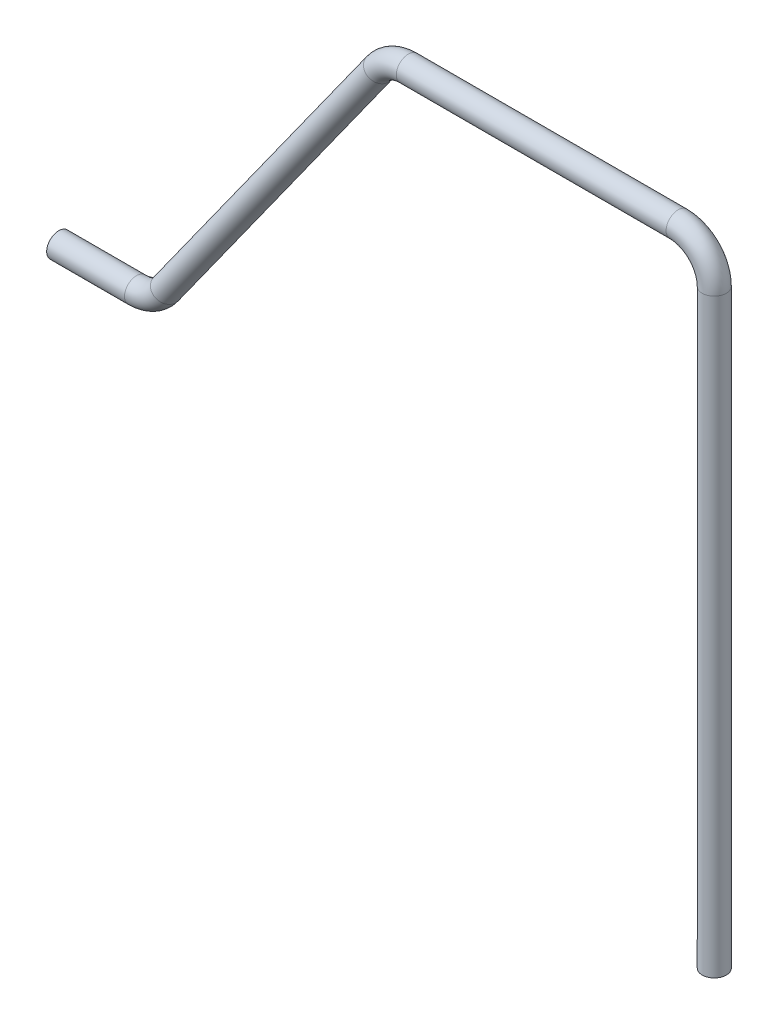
from build123d import *

# Parameters (mm, degrees)
SKETCH2_R = 1.5875


with BuildPart() as part:
    # Base-Sweep: sweep along a path in Sketch1
    with BuildLine(Plane.XY) as base_sweep_path:
        Line((0, 0), (10.252208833, 0))
        ThreePointArc((10.252208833, 0), (12.42927746, 0.526726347), (14.124784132, 1.990394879))
        Line((14.124784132, 1.990394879), (42.184750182, 41.189605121))
        ThreePointArc((42.184750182, 41.189605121), (43.880256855, 42.653273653), (46.057325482, 43.18))
        Line((46.057325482, 43.18), (81.5975, 43.18))
        ThreePointArc((81.5975, 43.18), (84.965096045, 41.785096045), (86.36, 38.4175))
        Line((86.36, 38.4175), (86.36, -39.37))
    # Sketch2 → Base-Sweep (sweep)
    with BuildSketch(Plane(origin=(0, 0, 0), x_dir=(0, 0, -1), z_dir=(1, 0, 0))):
        Circle(SKETCH2_R)
    sweep(path=base_sweep_path.line)


solid = part.part
